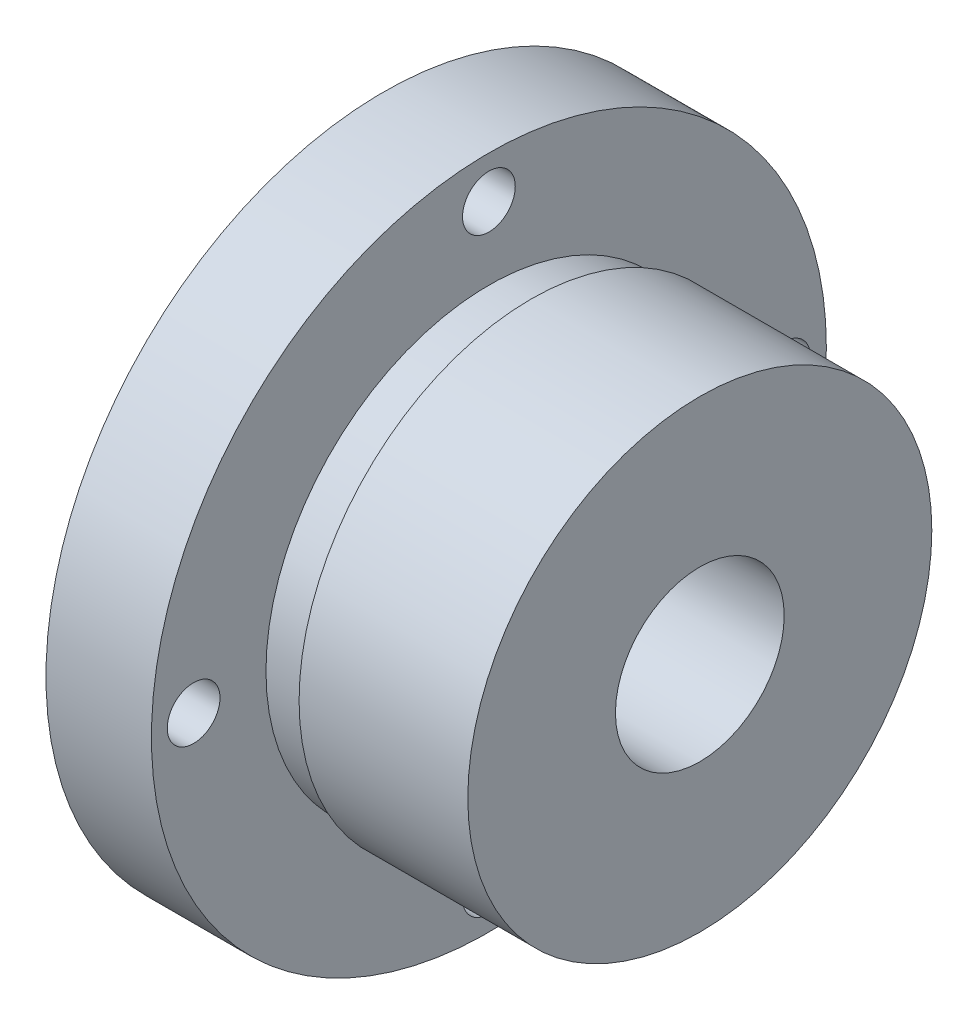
from build123d import *

# Parameters (mm, degrees)
HOLE_WIZARD_M3_1_D  = 2.5
CUT_EXTRUDE_1_REACH = 29.148
SKETCH_5_R          = 4


with BuildPart() as part:
    # Sketch 1 → Revolve 1 (revolve)
    with BuildSketch(Plane.XY, mode=Mode.PRIVATE) as revolve_1_sk:
        Polygon((0, 0), (0, 16), (5, 16), (5, 10.57), (7, 10.57), (7, 11), (15, 11), (15, 0), align=None)
    revolve(revolve_1_sk.sketch.rotate(Axis((15, 0, 0), (-1, 0, 0)), 90), axis=Axis((15, 0, 0), (-1, 0, 0)))

    # Hole Wizard M3 _1 (through all)
    with Locations(Plane(origin=(0, 0, -14), x_dir=(0, 0, -1), z_dir=(-1, 0, 0))):
        with Locations((0, 0), (-14, -14), (-28, 0), (-14, 14)):
            Hole(HOLE_WIZARD_M3_1_D / 2)

    # Sketch 5 → Cut-Extrude 1 (cut, up to next)
    with BuildSketch(Plane.ZY, mode=Mode.PRIVATE) as cut_extrude_1_sk1:
        Circle(SKETCH_5_R)
    cut_extrude_1_tool1 = extrude(cut_extrude_1_sk1.sketch, amount=-CUT_EXTRUDE_1_REACH, mode=Mode.PRIVATE) & part.part
    add(cut_extrude_1_tool1.solids().sort_by_distance((0, 0, 0))[0], mode=Mode.SUBTRACT)


solid = part.part
